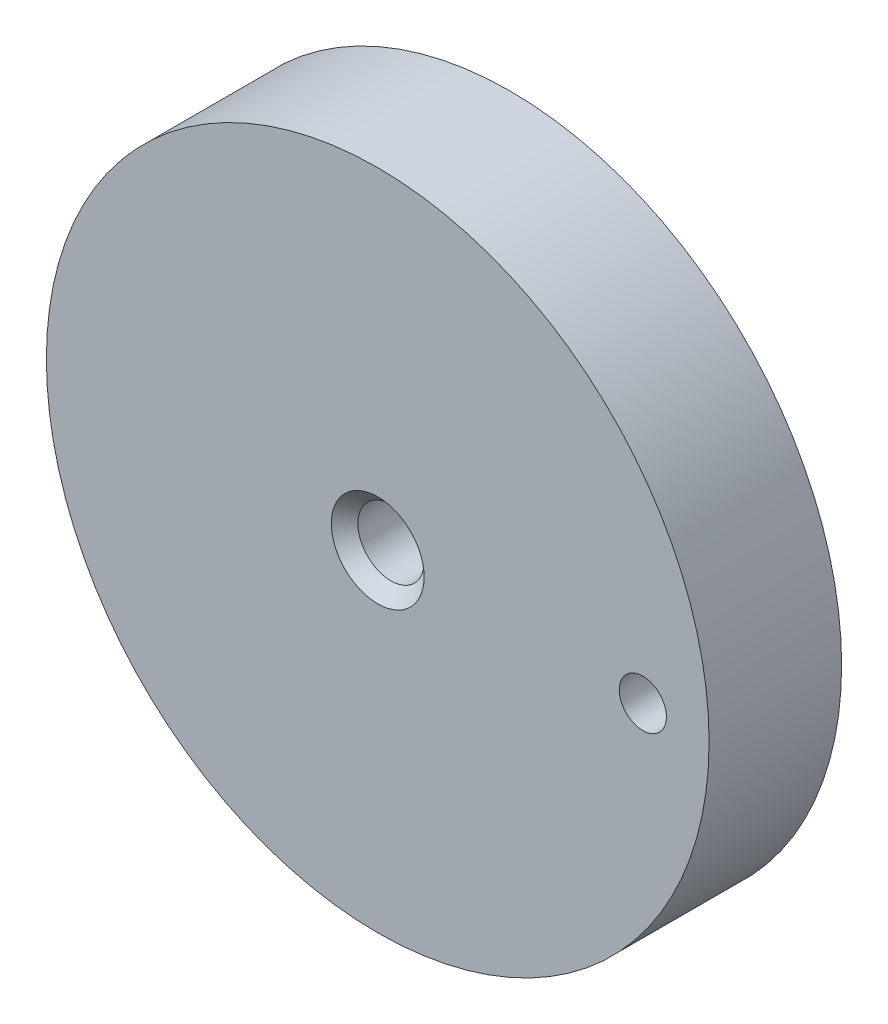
ISO-10303-21;
HEADER;
FILE_DESCRIPTION(('STEP AP214'),'2;1');
FILE_NAME('part.step','',(''),(''),'','','');
FILE_SCHEMA(('AUTOMOTIVE_DESIGN { 1 0 10303 214 1 1 1 1 }'));
ENDSEC;
DATA;
#1=APPLICATION_CONTEXT('core data for automotive mechanical design processes');
#2=APPLICATION_PROTOCOL_DEFINITION('international standard','automotive_design',2000,#1);
#3=PRODUCT_CONTEXT('',#1,'mechanical');
#4=PRODUCT('Part','Part','',(#3));
#5=PRODUCT_RELATED_PRODUCT_CATEGORY('part','',(#4));
#6=PRODUCT_DEFINITION_FORMATION('','',#4);
#7=PRODUCT_DEFINITION_CONTEXT('part definition',#1,'design');
#8=PRODUCT_DEFINITION('design','',#6,#7);
#9=PRODUCT_DEFINITION_SHAPE('','',#8);
#10=(LENGTH_UNIT() NAMED_UNIT(*) SI_UNIT(.MILLI.,.METRE.));
#11=(NAMED_UNIT(*) PLANE_ANGLE_UNIT() SI_UNIT($,.RADIAN.));
#12=(NAMED_UNIT(*) SI_UNIT($,.STERADIAN.) SOLID_ANGLE_UNIT());
#13=UNCERTAINTY_MEASURE_WITH_UNIT(LENGTH_MEASURE(1.E-05),#10,'distance_accuracy_value','');
#14=(GEOMETRIC_REPRESENTATION_CONTEXT(3) GLOBAL_UNCERTAINTY_ASSIGNED_CONTEXT((#13)) GLOBAL_UNIT_ASSIGNED_CONTEXT((#10,
#11,#12)) REPRESENTATION_CONTEXT('',''));
#15=CARTESIAN_POINT('',(0.,0.,0.));
#16=DIRECTION('',(0.,0.,1.));
#17=DIRECTION('',(1.,0.,0.));
#18=AXIS2_PLACEMENT_3D('',#15,#16,#17);
#19=CARTESIAN_POINT('',(0.,0.,6.35));
#20=DIRECTION('',(0.,0.,-1.));
#21=DIRECTION('',(-1.,0.,0.));
#22=AXIS2_PLACEMENT_3D('',#19,#20,#21);
#23=CYLINDRICAL_SURFACE('',#22,6.35);
#24=CARTESIAN_POINT('',(0.,-6.35,2.07220986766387));
#25=CARTESIAN_POINT('',(-0.0629563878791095,-6.3499988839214,2.07221233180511));
#26=CARTESIAN_POINT('',(-0.125945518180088,-6.34905403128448,2.07748753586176));
#27=CARTESIAN_POINT('',(-0.250152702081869,-6.3453758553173,2.0984376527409));
#28=CARTESIAN_POINT('',(-0.31136914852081,-6.34264095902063,2.11412171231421));
#29=CARTESIAN_POINT('',(-0.430216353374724,-6.33568901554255,2.1553973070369));
#30=CARTESIAN_POINT('',(-0.487850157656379,-6.33147324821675,2.18098028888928));
#31=CARTESIAN_POINT('',(-0.598001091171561,-6.32202140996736,2.24130410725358));
#32=CARTESIAN_POINT('',(-0.650518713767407,-6.31678543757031,2.27604405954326));
#33=CARTESIAN_POINT('',(-0.749522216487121,-6.3058088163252,2.35409592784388));
#34=CARTESIAN_POINT('',(-0.795944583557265,-6.30006376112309,2.39748779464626));
#35=CARTESIAN_POINT('',(-0.88089074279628,-6.28874965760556,2.49143971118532));
#36=CARTESIAN_POINT('',(-0.919414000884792,-6.28318062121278,2.54200024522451));
#37=CARTESIAN_POINT('',(-0.987728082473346,-6.27280636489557,2.64929727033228));
#38=CARTESIAN_POINT('',(-1.01745513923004,-6.26800683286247,2.70607495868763));
#39=CARTESIAN_POINT('',(-1.0669249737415,-6.2597766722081,2.82391797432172));
#40=CARTESIAN_POINT('',(-1.08666852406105,-6.25634593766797,2.88498296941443));
#41=CARTESIAN_POINT('',(-1.11540879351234,-6.2512859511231,3.00899048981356));
#42=CARTESIAN_POINT('',(-1.12451576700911,-6.24963823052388,3.07190669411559));
#43=CARTESIAN_POINT('',(-1.1320664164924,-6.24827506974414,3.19839404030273));
#44=CARTESIAN_POINT('',(-1.13051095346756,-6.24855947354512,3.2619651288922));
#45=CARTESIAN_POINT('',(-1.11687047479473,-6.25101158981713,3.38716446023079));
#46=CARTESIAN_POINT('',(-1.10491011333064,-6.25315700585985,3.44880678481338));
#47=CARTESIAN_POINT('',(-1.07099533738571,-6.25905444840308,3.56919568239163));
#48=CARTESIAN_POINT('',(-1.049040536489,-6.26280653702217,3.62794214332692));
#49=CARTESIAN_POINT('',(-0.995636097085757,-6.2715182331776,3.74124041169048));
#50=CARTESIAN_POINT('',(-0.964135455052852,-6.27648429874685,3.7957676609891));
#51=CARTESIAN_POINT('',(-0.892569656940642,-6.28706003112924,3.8988095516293));
#52=CARTESIAN_POINT('',(-0.852503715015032,-6.29266975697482,3.94732364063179));
#53=CARTESIAN_POINT('',(-0.764269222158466,-6.30399827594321,4.03768293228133));
#54=CARTESIAN_POINT('',(-0.715993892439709,-6.30971748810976,4.07942388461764));
#55=CARTESIAN_POINT('',(-0.613070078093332,-6.32054731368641,4.15422958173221));
#56=CARTESIAN_POINT('',(-0.5584215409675,-6.32565792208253,4.18729425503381));
#57=CARTESIAN_POINT('',(-0.444198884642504,-6.33470353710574,4.24382139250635));
#58=CARTESIAN_POINT('',(-0.384619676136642,-6.33863730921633,4.26727378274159));
#59=CARTESIAN_POINT('',(-0.262282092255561,-6.34487632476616,4.3038093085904));
#60=CARTESIAN_POINT('',(-0.199524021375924,-6.34718172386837,4.31689343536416));
#61=CARTESIAN_POINT('',(-0.0735078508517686,-6.34988306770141,4.33217769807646));
#62=CARTESIAN_POINT('',(-0.0102676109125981,-6.35030409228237,4.33452080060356));
#63=CARTESIAN_POINT('',(0.1157013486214,-6.34925825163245,4.3286388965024));
#64=CARTESIAN_POINT('',(0.178430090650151,-6.34779146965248,4.32041435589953));
#65=CARTESIAN_POINT('',(0.301147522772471,-6.34315039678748,4.29374952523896));
#66=CARTESIAN_POINT('',(0.361152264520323,-6.33998807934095,4.27538084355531));
#67=CARTESIAN_POINT('',(0.477230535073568,-6.33230904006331,4.22902609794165));
#68=CARTESIAN_POINT('',(0.533303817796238,-6.32779223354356,4.20103943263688));
#69=CARTESIAN_POINT('',(0.640542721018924,-6.31784277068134,4.13592156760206));
#70=CARTESIAN_POINT('',(0.691653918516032,-6.31240144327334,4.0987020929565));
#71=CARTESIAN_POINT('',(0.786956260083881,-6.30123054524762,4.01629550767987));
#72=CARTESIAN_POINT('',(0.831146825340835,-6.29550095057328,3.97110773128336));
#73=CARTESIAN_POINT('',(0.911890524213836,-6.28431705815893,3.87340278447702));
#74=CARTESIAN_POINT('',(0.948346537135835,-6.27886684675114,3.82080480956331));
#75=CARTESIAN_POINT('',(1.01190558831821,-6.26893820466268,3.7101474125));
#76=CARTESIAN_POINT('',(1.03900895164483,-6.2644597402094,3.65208818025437));
#77=CARTESIAN_POINT('',(1.08295206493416,-6.25701307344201,3.53241464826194));
#78=CARTESIAN_POINT('',(1.09983812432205,-6.25403806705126,3.47081779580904));
#79=CARTESIAN_POINT('',(1.12301156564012,-6.24991887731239,3.3456039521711));
#80=CARTESIAN_POINT('',(1.12930001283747,-6.24877450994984,3.28198716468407));
#81=CARTESIAN_POINT('',(1.13106684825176,-6.24845484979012,3.15551065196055));
#82=CARTESIAN_POINT('',(1.12669827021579,-6.24925168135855,3.09265308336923));
#83=CARTESIAN_POINT('',(1.10760816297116,-6.25266316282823,2.96858311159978));
#84=CARTESIAN_POINT('',(1.09288668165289,-6.25527780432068,2.90737070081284));
#85=CARTESIAN_POINT('',(1.05357047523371,-6.26201909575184,2.7884001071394));
#86=CARTESIAN_POINT('',(1.02899073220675,-6.26614345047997,2.73063683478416));
#87=CARTESIAN_POINT('',(0.970671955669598,-6.27544134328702,2.62002930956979));
#88=CARTESIAN_POINT('',(0.936932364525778,-6.28061494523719,2.5671853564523));
#89=CARTESIAN_POINT('',(0.860712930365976,-6.29151580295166,2.4671467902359));
#90=CARTESIAN_POINT('',(0.818121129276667,-6.29724959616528,2.42003817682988));
#91=CARTESIAN_POINT('',(0.725641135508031,-6.30857437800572,2.33358504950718));
#92=CARTESIAN_POINT('',(0.675751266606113,-6.31416533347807,2.29424232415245));
#93=CARTESIAN_POINT('',(0.569614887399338,-6.32462666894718,2.22414661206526));
#94=CARTESIAN_POINT('',(0.513320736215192,-6.32949092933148,2.19346482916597));
#95=CARTESIAN_POINT('',(0.396310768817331,-6.33789122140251,2.1420421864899));
#96=CARTESIAN_POINT('',(0.335599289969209,-6.34142853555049,2.12129172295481));
#97=CARTESIAN_POINT('',(0.228901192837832,-6.34603119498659,2.09467147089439));
#98=CARTESIAN_POINT('',(0.183549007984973,-6.34751130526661,2.08626233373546));
#99=CARTESIAN_POINT('',(0.0921370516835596,-6.34949610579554,2.07503068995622));
#100=CARTESIAN_POINT('',(0.0460772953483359,-6.35000081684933,2.07220806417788));
#101=CARTESIAN_POINT('',(0.,-6.35,2.07220986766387));
#102=B_SPLINE_CURVE_WITH_KNOTS('',3,(#24,#25,#26,#27,#28,#29,#30,#31,#32,#33,#34,#35,#36,#37,
#38,#39,#40,#41,#42,#43,#44,#45,#46,#47,#48,#49,#50,#51,#52,#53,#54,#55,#56,#57,#58,#59,#60,#61,
#62,#63,#64,#65,#66,#67,#68,#69,#70,#71,#72,#73,#74,#75,#76,#77,#78,#79,#80,#81,#82,#83,#84,#85,
#86,#87,#88,#89,#90,#91,#92,#93,#94,#95,#96,#97,#98,#99,#100,#101),.UNSPECIFIED.,.T.,.F.,(4,2,2,
2,2,2,2,2,2,2,2,2,2,2,2,2,2,2,2,2,2,2,2,2,2,2,2,2,2,2,2,2,2,2,2,2,2,2,4),(0.,0.188700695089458,
0.377567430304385,0.566271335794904,0.754957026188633,0.945474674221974,1.13600519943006,
1.32788488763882,1.51974972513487,1.70960760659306,1.89945015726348,2.08704917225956,
2.27465544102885,2.46328231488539,2.65192650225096,2.84324403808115,3.03456314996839,
3.22608225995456,3.41758305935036,3.60652737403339,3.79546335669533,3.98308236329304,
4.17071310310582,4.36021202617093,4.5497267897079,4.74149628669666,4.93325911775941,
5.1241461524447,5.31501399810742,5.50315717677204,5.69129948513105,5.879156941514,
6.06702583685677,6.25743369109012,6.44788534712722,6.63985995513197,6.83164854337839,
6.96976007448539,7.10786865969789),.UNSPECIFIED.);
#103=CARTESIAN_POINT('',(0.,-6.35,2.07220986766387));
#104=VERTEX_POINT('',#103);
#105=EDGE_CURVE('E62',#104,#104,#102,.T.);
#106=ORIENTED_EDGE('',*,*,#105,.T.);
#107=EDGE_LOOP('',(#106));
#108=FACE_BOUND('',#107,.T.);
#109=CARTESIAN_POINT('',(0.,0.,6.35));
#110=DIRECTION('',(0.,0.,1.));
#111=DIRECTION('',(1.,0.,0.));
#112=AXIS2_PLACEMENT_3D('',#109,#110,#111);
#113=CIRCLE('',#112,6.35);
#114=CARTESIAN_POINT('',(6.35,0.,6.35));
#115=VERTEX_POINT('',#114);
#116=EDGE_CURVE('E44',#115,#115,#113,.T.);
#117=ORIENTED_EDGE('',*,*,#116,.F.);
#118=EDGE_LOOP('',(#117));
#119=FACE_BOUND('',#118,.T.);
#120=CARTESIAN_POINT('',(0.,0.,0.));
#121=DIRECTION('',(0.,0.,1.));
#122=DIRECTION('',(1.,0.,0.));
#123=AXIS2_PLACEMENT_3D('',#120,#121,#122);
#124=CIRCLE('',#123,6.35);
#125=CARTESIAN_POINT('',(6.35,0.,0.));
#126=VERTEX_POINT('',#125);
#127=EDGE_CURVE('E48',#126,#126,#124,.T.);
#128=ORIENTED_EDGE('',*,*,#127,.T.);
#129=EDGE_LOOP('',(#128));
#130=FACE_BOUND('',#129,.T.);
#131=ADVANCED_FACE('F33',(#108,#119,#130),#23,.T.);
#132=CARTESIAN_POINT('',(0.,0.,0.));
#133=DIRECTION('',(0.,0.,1.));
#134=DIRECTION('',(1.,0.,0.));
#135=AXIS2_PLACEMENT_3D('',#132,#133,#134);
#136=PLANE('',#135);
#137=CARTESIAN_POINT('',(0.,0.,0.));
#138=DIRECTION('',(0.,0.,-1.));
#139=DIRECTION('',(-1.,0.,0.));
#140=AXIS2_PLACEMENT_3D('',#137,#138,#139);
#141=CIRCLE('',#140,1.5875);
#142=CARTESIAN_POINT('',(-1.5875,0.,0.));
#143=VERTEX_POINT('',#142);
#144=EDGE_CURVE('E57',#143,#143,#141,.T.);
#145=ORIENTED_EDGE('',*,*,#144,.F.);
#146=EDGE_LOOP('',(#145));
#147=FACE_BOUND('',#146,.T.);
#148=ORIENTED_EDGE('',*,*,#127,.F.);
#149=EDGE_LOOP('',(#148));
#150=FACE_BOUND('',#149,.T.);
#151=ADVANCED_FACE('F95',(#147,#150),#136,.F.);
#152=CARTESIAN_POINT('',(0.,0.,6.35));
#153=DIRECTION('',(0.,0.,1.));
#154=DIRECTION('',(1.,0.,0.));
#155=AXIS2_PLACEMENT_3D('',#152,#153,#154);
#156=PLANE('',#155);
#157=CARTESIAN_POINT('',(12.7,0.,6.35));
#158=DIRECTION('',(0.,0.,1.));
#159=DIRECTION('',(1.,0.,0.));
#160=AXIS2_PLACEMENT_3D('',#157,#158,#159);
#161=CIRCLE('',#160,1.13029999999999);
#162=CARTESIAN_POINT('',(13.8303,0.,6.35));
#163=VERTEX_POINT('',#162);
#164=EDGE_CURVE('E171',#163,#163,#161,.T.);
#165=ORIENTED_EDGE('',*,*,#164,.T.);
#166=EDGE_LOOP('',(#165));
#167=FACE_BOUND('',#166,.T.);
#168=CARTESIAN_POINT('',(0.,0.,6.35));
#169=DIRECTION('',(0.,0.,1.));
#170=DIRECTION('',(1.,0.,0.));
#171=AXIS2_PLACEMENT_3D('',#168,#169,#170);
#172=CIRCLE('',#171,15.875);
#173=CARTESIAN_POINT('',(15.875,0.,6.35));
#174=VERTEX_POINT('',#173);
#175=EDGE_CURVE('E54',#174,#174,#172,.T.);
#176=ORIENTED_EDGE('',*,*,#175,.F.);
#177=EDGE_LOOP('',(#176));
#178=FACE_BOUND('',#177,.T.);
#179=ORIENTED_EDGE('',*,*,#116,.T.);
#180=EDGE_LOOP('',(#179));
#181=FACE_BOUND('',#180,.T.);
#182=ADVANCED_FACE('F92',(#167,#178,#181),#156,.F.);
#183=CARTESIAN_POINT('',(0.,0.,12.7));
#184=DIRECTION('',(0.,0.,-1.));
#185=DIRECTION('',(-1.,0.,0.));
#186=AXIS2_PLACEMENT_3D('',#183,#184,#185);
#187=CYLINDRICAL_SURFACE('',#186,15.875);
#188=CARTESIAN_POINT('',(0.,0.,12.7));
#189=DIRECTION('',(0.,0.,1.));
#190=DIRECTION('',(1.,0.,0.));
#191=AXIS2_PLACEMENT_3D('',#188,#189,#190);
#192=CIRCLE('',#191,15.875);
#193=CARTESIAN_POINT('',(15.875,0.,12.7));
#194=VERTEX_POINT('',#193);
#195=EDGE_CURVE('E52',#194,#194,#192,.T.);
#196=ORIENTED_EDGE('',*,*,#195,.F.);
#197=EDGE_LOOP('',(#196));
#198=FACE_BOUND('',#197,.T.);
#199=ORIENTED_EDGE('',*,*,#175,.T.);
#200=EDGE_LOOP('',(#199));
#201=FACE_BOUND('',#200,.T.);
#202=ADVANCED_FACE('F90',(#198,#201),#187,.T.);
#203=CARTESIAN_POINT('',(0.,0.,12.7));
#204=DIRECTION('',(0.,0.,1.));
#205=DIRECTION('',(1.,0.,0.));
#206=AXIS2_PLACEMENT_3D('',#203,#204,#205);
#207=PLANE('',#206);
#208=CARTESIAN_POINT('',(12.7,0.,12.7));
#209=DIRECTION('',(0.,0.,1.));
#210=DIRECTION('',(1.,0.,0.));
#211=AXIS2_PLACEMENT_3D('',#208,#209,#210);
#212=CIRCLE('',#211,1.13029999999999);
#213=CARTESIAN_POINT('',(13.8303,0.,12.7));
#214=VERTEX_POINT('',#213);
#215=EDGE_CURVE('E168',#214,#214,#212,.T.);
#216=ORIENTED_EDGE('',*,*,#215,.F.);
#217=EDGE_LOOP('',(#216));
#218=FACE_BOUND('',#217,.T.);
#219=CARTESIAN_POINT('',(0.,0.,12.7));
#220=DIRECTION('',(0.,0.,1.));
#221=DIRECTION('',(1.,0.,0.));
#222=AXIS2_PLACEMENT_3D('',#219,#220,#221);
#223=CIRCLE('',#222,2.2225);
#224=CARTESIAN_POINT('',(2.2225,0.,12.7));
#225=VERTEX_POINT('',#224);
#226=EDGE_CURVE('E40',#225,#225,#223,.F.);
#227=ORIENTED_EDGE('',*,*,#226,.T.);
#228=EDGE_LOOP('',(#227));
#229=FACE_BOUND('',#228,.T.);
#230=ORIENTED_EDGE('',*,*,#195,.T.);
#231=EDGE_LOOP('',(#230));
#232=FACE_BOUND('',#231,.T.);
#233=ADVANCED_FACE('F87',(#218,#229,#232),#207,.T.);
#234=CARTESIAN_POINT('',(0.,0.,12.7));
#235=DIRECTION('',(0.,0.,-1.));
#236=DIRECTION('',(-1.,0.,0.));
#237=AXIS2_PLACEMENT_3D('',#234,#235,#236);
#238=CYLINDRICAL_SURFACE('',#237,1.5875);
#239=CARTESIAN_POINT('',(0.,0.,12.065));
#240=DIRECTION('',(0.,0.,1.));
#241=DIRECTION('',(1.,0.,0.));
#242=AXIS2_PLACEMENT_3D('',#239,#240,#241);
#243=CIRCLE('',#242,1.5875);
#244=CARTESIAN_POINT('',(1.5875,0.,12.065));
#245=VERTEX_POINT('',#244);
#246=EDGE_CURVE('E10',#245,#245,#243,.T.);
#247=ORIENTED_EDGE('',*,*,#246,.T.);
#248=EDGE_LOOP('',(#247));
#249=FACE_BOUND('',#248,.T.);
#250=CARTESIAN_POINT('',(0.,-1.5875,2.07220986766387));
#251=CARTESIAN_POINT('',(0.0559804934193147,-1.58750061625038,2.07220916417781));
#252=CARTESIAN_POINT('',(0.111958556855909,-1.5845140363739,2.07639230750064));
#253=CARTESIAN_POINT('',(0.222107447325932,-1.5728622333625,2.09284741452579));
#254=CARTESIAN_POINT('',(0.276277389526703,-1.5641942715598,2.10512327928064));
#255=CARTESIAN_POINT('',(0.381034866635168,-1.54201976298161,2.13696950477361));
#256=CARTESIAN_POINT('',(0.431638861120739,-1.52853746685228,2.15650332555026));
#257=CARTESIAN_POINT('',(0.52859001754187,-1.49777803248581,2.20198938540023));
#258=CARTESIAN_POINT('',(0.574936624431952,-1.48050040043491,2.22794245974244));
#259=CARTESIAN_POINT('',(0.666751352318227,-1.44163137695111,2.28801779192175));
#260=CARTESIAN_POINT('',(0.711770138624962,-1.41979237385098,2.32266309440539));
#261=CARTESIAN_POINT('',(0.795759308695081,-1.374483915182,2.39781891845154));
#262=CARTESIAN_POINT('',(0.834720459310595,-1.35101204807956,2.43833821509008));
#263=CARTESIAN_POINT('',(0.912797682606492,-1.29981128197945,2.53259650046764));
#264=CARTESIAN_POINT('',(0.950642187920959,-1.27208790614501,2.58739829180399));
#265=CARTESIAN_POINT('',(1.016634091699,-1.21998934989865,2.70400730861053));
#266=CARTESIAN_POINT('',(1.04479704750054,-1.19560883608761,2.76580308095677));
#267=CARTESIAN_POINT('',(1.08280766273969,-1.16108653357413,2.87495439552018));
#268=CARTESIAN_POINT('',(1.09563220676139,-1.14888436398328,2.92061317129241));
#269=CARTESIAN_POINT('',(1.11551991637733,-1.12958689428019,3.01417398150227));
#270=CARTESIAN_POINT('',(1.12259520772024,-1.12248084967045,3.06207106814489));
#271=CARTESIAN_POINT('',(1.13052707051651,-1.11449591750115,3.15923040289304));
#272=CARTESIAN_POINT('',(1.1313441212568,-1.11365660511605,3.20849935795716));
#273=CARTESIAN_POINT('',(1.12658284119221,-1.11847036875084,3.30642124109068));
#274=CARTESIAN_POINT('',(1.1209991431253,-1.12412889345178,3.35507361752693));
#275=CARTESIAN_POINT('',(1.10275632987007,-1.14204362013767,3.45647319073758));
#276=CARTESIAN_POINT('',(1.08927241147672,-1.15506131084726,3.50893145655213));
#277=CARTESIAN_POINT('',(1.05558580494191,-1.18592314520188,3.61015805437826));
#278=CARTESIAN_POINT('',(1.03536833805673,-1.20377788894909,3.65891797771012));
#279=CARTESIAN_POINT('',(0.981849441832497,-1.24806617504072,3.76659182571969));
#280=CARTESIAN_POINT('',(0.946437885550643,-1.27545454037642,3.82406029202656));
#281=CARTESIAN_POINT('',(0.866316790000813,-1.33118035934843,3.93160108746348));
#282=CARTESIAN_POINT('',(0.821598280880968,-1.35951870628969,3.98166620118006));
#283=CARTESIAN_POINT('',(0.722894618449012,-1.41449769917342,4.07406683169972));
#284=CARTESIAN_POINT('',(0.668826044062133,-1.44111981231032,4.11632499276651));
#285=CARTESIAN_POINT('',(0.552443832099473,-1.48960108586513,4.1910123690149));
#286=CARTESIAN_POINT('',(0.490149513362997,-1.51147109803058,4.22346404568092));
#287=CARTESIAN_POINT('',(0.375583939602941,-1.54326764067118,4.26989068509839));
#288=CARTESIAN_POINT('',(0.324813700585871,-1.55481788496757,4.28646758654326));
#289=CARTESIAN_POINT('',(0.22060427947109,-1.57298393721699,4.31236882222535));
#290=CARTESIAN_POINT('',(0.167167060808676,-1.57960331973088,4.32169841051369));
#291=CARTESIAN_POINT('',(0.0589342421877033,-1.58733577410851,4.33258577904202));
#292=CARTESIAN_POINT('',(0.00413496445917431,-1.58843181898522,4.33411952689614));
#293=CARTESIAN_POINT('',(-0.10493100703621,-1.58496780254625,4.32925193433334));
#294=CARTESIAN_POINT('',(-0.159197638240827,-1.58040708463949,4.32284967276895));
#295=CARTESIAN_POINT('',(-0.263089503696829,-1.56638561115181,4.30297888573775));
#296=CARTESIAN_POINT('',(-0.312813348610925,-1.55716087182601,4.28985034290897));
#297=CARTESIAN_POINT('',(-0.409193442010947,-1.53465593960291,4.25736885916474));
#298=CARTESIAN_POINT('',(-0.455849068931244,-1.52137492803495,4.2380146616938));
#299=CARTESIAN_POINT('',(-0.549478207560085,-1.49026266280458,4.19176450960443));
#300=CARTESIAN_POINT('',(-0.596086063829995,-1.4721251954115,4.16433852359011));
#301=CARTESIAN_POINT('',(-0.684240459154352,-1.43328166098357,4.10376370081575));
#302=CARTESIAN_POINT('',(-0.725782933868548,-1.41257355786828,4.07061031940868));
#303=CARTESIAN_POINT('',(-0.810510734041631,-1.36600339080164,3.99278385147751));
#304=CARTESIAN_POINT('',(-0.852638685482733,-1.33988578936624,3.94711161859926));
#305=CARTESIAN_POINT('',(-0.929019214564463,-1.28810205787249,3.84931297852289));
#306=CARTESIAN_POINT('',(-0.963267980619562,-1.26243615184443,3.79718346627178));
#307=CARTESIAN_POINT('',(-1.01839870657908,-1.21822092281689,3.69568339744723));
#308=CARTESIAN_POINT('',(-1.0405436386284,-1.1991904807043,3.64721205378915));
#309=CARTESIAN_POINT('',(-1.07808605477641,-1.16555754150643,3.54630031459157));
#310=CARTESIAN_POINT('',(-1.09349782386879,-1.15094569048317,3.49386860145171));
#311=CARTESIAN_POINT('',(-1.11458191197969,-1.13050476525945,3.39570981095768));
#312=CARTESIAN_POINT('',(-1.12151372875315,-1.12356339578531,3.35049153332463));
#313=CARTESIAN_POINT('',(-1.12981481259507,-1.11521859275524,3.25905734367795));
#314=CARTESIAN_POINT('',(-1.13118997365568,-1.11380929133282,3.2128425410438));
#315=CARTESIAN_POINT('',(-1.12828273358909,-1.11675298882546,3.12079480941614));
#316=CARTESIAN_POINT('',(-1.12400126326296,-1.1211050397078,3.07496181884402));
#317=CARTESIAN_POINT('',(-1.11008964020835,-1.13487874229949,2.98487649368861));
#318=CARTESIAN_POINT('',(-1.10045126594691,-1.14430818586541,2.94062670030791));
#319=CARTESIAN_POINT('',(-1.07217677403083,-1.17093316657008,2.83970312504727));
#320=CARTESIAN_POINT('',(-1.0515855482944,-1.18968464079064,2.78399527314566));
#321=CARTESIAN_POINT('',(-1.00275963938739,-1.23111911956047,2.67763787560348));
#322=CARTESIAN_POINT('',(-0.974512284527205,-1.25380861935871,2.62699690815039));
#323=CARTESIAN_POINT('',(-0.910219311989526,-1.3012673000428,2.52978354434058));
#324=CARTESIAN_POINT('',(-0.873987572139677,-1.32607556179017,2.48335378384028));
#325=CARTESIAN_POINT('',(-0.794587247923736,-1.37512474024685,2.39648713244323));
#326=CARTESIAN_POINT('',(-0.751416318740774,-1.39936546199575,2.35605227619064));
#327=CARTESIAN_POINT('',(-0.650842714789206,-1.44920713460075,2.27581328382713));
#328=CARTESIAN_POINT('',(-0.592267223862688,-1.47438345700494,2.23719111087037));
#329=CARTESIAN_POINT('',(-0.467166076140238,-1.51864614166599,2.17085252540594));
#330=CARTESIAN_POINT('',(-0.400655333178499,-1.53774368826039,2.14311606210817));
#331=CARTESIAN_POINT('',(-0.278366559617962,-1.56384199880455,2.10562529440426));
#332=CARTESIAN_POINT('',(-0.223798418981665,-1.57263958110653,2.09316306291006));
#333=CARTESIAN_POINT('',(-0.112818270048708,-1.58446577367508,2.07645926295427));
#334=CARTESIAN_POINT('',(-0.0564079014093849,-1.58749937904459,2.07221057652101));
#335=CARTESIAN_POINT('',(0.,-1.5875,2.07220986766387));
#336=B_SPLINE_CURVE_WITH_KNOTS('',3,(#250,#251,#252,#253,#254,#255,#256,#257,#258,#259,#260,
#261,#262,#263,#264,#265,#266,#267,#268,#269,#270,#271,#272,#273,#274,#275,#276,#277,#278,#279,
#280,#281,#282,#283,#284,#285,#286,#287,#288,#289,#290,#291,#292,#293,#294,#295,#296,#297,#298,
#299,#300,#301,#302,#303,#304,#305,#306,#307,#308,#309,#310,#311,#312,#313,#314,#315,#316,#317,
#318,#319,#320,#321,#322,#323,#324,#325,#326,#327,#328,#329,#330,#331,#332,#333,#334,#335),
.UNSPECIFIED.,.T.,.F.,(4,2,2,2,2,2,2,2,2,2,2,2,2,2,2,2,2,2,2,2,2,2,2,2,2,2,2,2,2,2,2,2,2,2,2,2,
2,2,2,2,2,2,4),(0.,0.167711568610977,0.335504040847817,0.502462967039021,0.669443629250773,
0.851359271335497,1.03354952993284,1.2490178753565,1.46413834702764,1.61050814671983,
1.75656843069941,1.90355032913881,2.05065556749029,2.21686783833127,2.38344734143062,
2.60088913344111,2.8185414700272,3.03824660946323,3.25744463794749,3.42068463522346,
3.58380617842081,3.74743027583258,3.9110733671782,4.06715922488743,4.22327660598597,
4.39375692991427,4.56437315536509,4.7657912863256,4.96730665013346,5.13649097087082,
5.30531458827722,5.44351764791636,5.58157407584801,5.7196077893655,5.85785393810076,
6.04368312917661,6.22982178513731,6.42087259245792,6.61198809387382,6.83432235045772,
7.0562451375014,7.22538381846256,7.39437585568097),.UNSPECIFIED.);
#337=CARTESIAN_POINT('',(0.,-1.5875,2.07220986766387));
#338=VERTEX_POINT('',#337);
#339=EDGE_CURVE('E68',#338,#338,#336,.T.);
#340=ORIENTED_EDGE('',*,*,#339,.T.);
#341=EDGE_LOOP('',(#340));
#342=FACE_BOUND('',#341,.T.);
#343=ORIENTED_EDGE('',*,*,#144,.T.);
#344=EDGE_LOOP('',(#343));
#345=FACE_BOUND('',#344,.T.);
#346=ADVANCED_FACE('F79',(#249,#342,#345),#238,.F.);
#347=CARTESIAN_POINT('',(0.,-6.35,3.20250986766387));
#348=DIRECTION('',(0.,-1.,0.));
#349=DIRECTION('',(0.,0.,-1.));
#350=AXIS2_PLACEMENT_3D('',#347,#348,#349);
#351=CYLINDRICAL_SURFACE('',#350,1.13029999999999);
#352=ORIENTED_EDGE('',*,*,#339,.F.);
#353=EDGE_LOOP('',(#352));
#354=FACE_BOUND('',#353,.T.);
#355=ORIENTED_EDGE('',*,*,#105,.F.);
#356=EDGE_LOOP('',(#355));
#357=FACE_BOUND('',#356,.T.);
#358=ADVANCED_FACE('F75',(#354,#357),#351,.F.);
#359=CARTESIAN_POINT('',(0.,0.,12.7));
#360=DIRECTION('',(0.,0.,1.));
#361=DIRECTION('',(1.,0.,0.));
#362=AXIS2_PLACEMENT_3D('',#359,#360,#361);
#363=CONICAL_SURFACE('',#362,2.2225,0.785398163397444);
#364=ORIENTED_EDGE('',*,*,#246,.F.);
#365=EDGE_LOOP('',(#364));
#366=FACE_BOUND('',#365,.T.);
#367=ORIENTED_EDGE('',*,*,#226,.F.);
#368=EDGE_LOOP('',(#367));
#369=FACE_BOUND('',#368,.T.);
#370=ADVANCED_FACE('F35',(#366,#369),#363,.F.);
#371=CARTESIAN_POINT('',(12.7,0.,12.7));
#372=DIRECTION('',(0.,0.,1.));
#373=DIRECTION('',(1.,0.,0.));
#374=AXIS2_PLACEMENT_3D('',#371,#372,#373);
#375=CYLINDRICAL_SURFACE('',#374,1.13029999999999);
#376=ORIENTED_EDGE('',*,*,#215,.T.);
#377=EDGE_LOOP('',(#376));
#378=FACE_BOUND('',#377,.T.);
#379=ORIENTED_EDGE('',*,*,#164,.F.);
#380=EDGE_LOOP('',(#379));
#381=FACE_BOUND('',#380,.T.);
#382=ADVANCED_FACE('F81',(#378,#381),#375,.F.);
#383=CLOSED_SHELL('',(#131,#151,#182,#202,#233,#346,#358,#370,#382));
#384=MANIFOLD_SOLID_BREP('B2',#383);
#385=ADVANCED_BREP_SHAPE_REPRESENTATION('',(#18,#384),#14);
#386=SHAPE_DEFINITION_REPRESENTATION(#9,#385);
ENDSEC;
END-ISO-10303-21;
